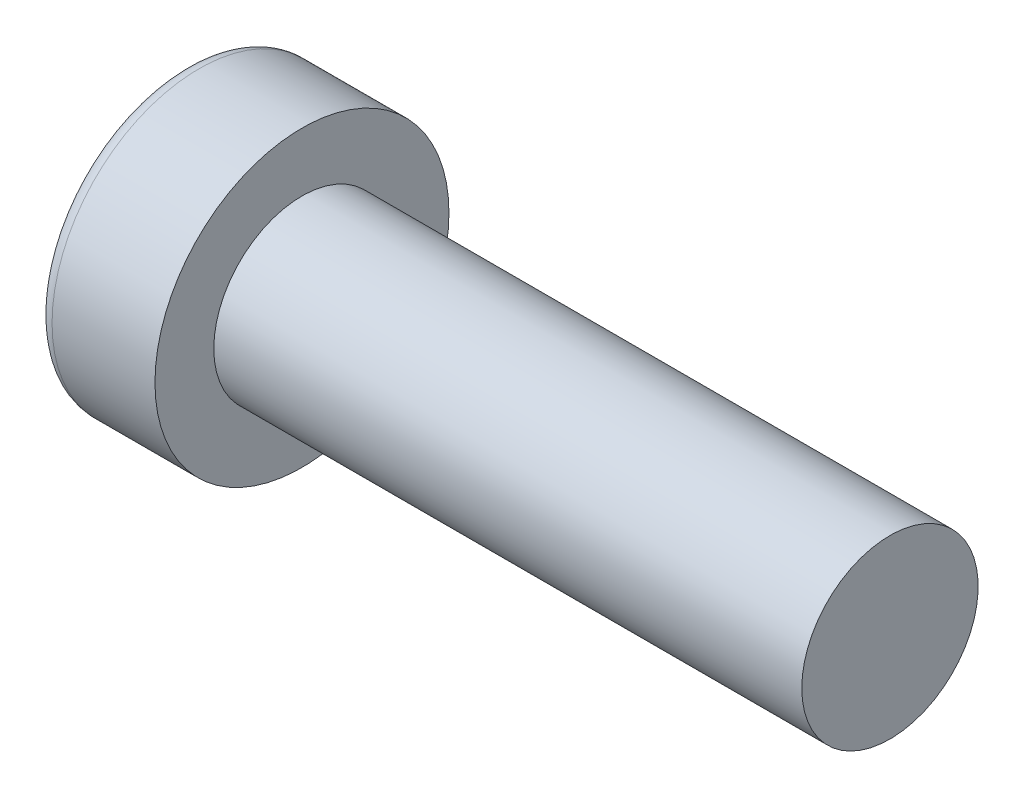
from build123d import *

# Parameters (mm, degrees)
VERRUNDUNG1_R                   = 0.5
SCHNITT_LINEAR_AUSTRAGEN1_DEPTH = 3


with BuildPart() as part:
    # Skizze1 → Rotation1 (revolve)
    with BuildSketch(Plane.XY, mode=Mode.PRIVATE) as rotation1_sk:
        Polygon((-24, 0), (-24, 5), (-20, 5), (-20, 3), (0, 3), (0, 0), align=None)
    revolve(rotation1_sk.sketch.rotate(Axis((-65.011808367, 0, 0), (1, 0, 0)), 90), axis=Axis((-65.011808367, 0, 0), (1, 0, 0)))

    # Verrundung1
    verrundung1_edges = [part.edges().sort_by_distance(p)[0] for p in [
        (-24, 0, -5),
    ]]
    fillet(verrundung1_edges, radius=VERRUNDUNG1_R)

    # Skizze2 → Schnitt-Linear austragen1 (cut)
    with BuildSketch(Plane.ZY.offset(24)):
        Polygon((2, 1.154700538), (0, 2.309401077), (-2, 1.154700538), (-2, -1.154700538), (0, -2.309401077), (2, -1.154700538), align=None)
    extrude(amount=-SCHNITT_LINEAR_AUSTRAGEN1_DEPTH, mode=Mode.SUBTRACT)


solid = part.part
